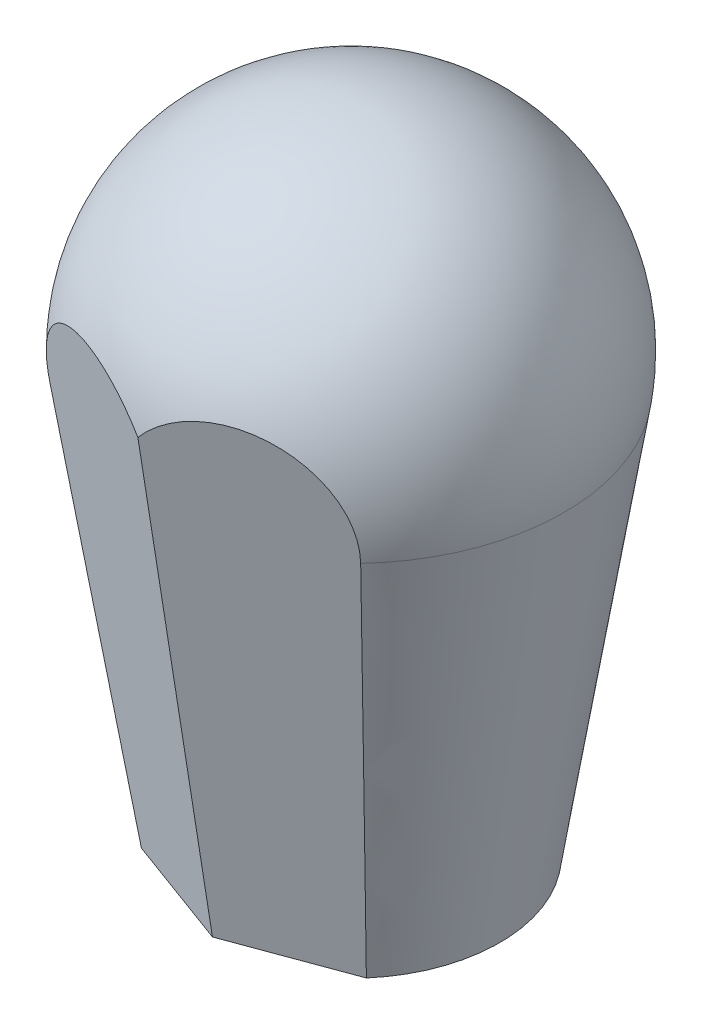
from build123d import *

# Parameters (mm, degrees)
ESQUISSE12_W            = 301.782848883
ESQUISSE12_H            = 290.028827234
ENL_V_MAT_EXTRU_1_DEPTH = 10


with BuildPart() as part:
    # Esquisse1 → R_volution1 (revolve)
    with BuildSketch(Plane.XY):
        with BuildLine():
            Line((0, 24), (-60, 24))
            Line((-60, 24), (-85.924784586, 187.364333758))
            ThreePointArc((-85.924784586, 187.364333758), (-66.163823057, 257.492021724), (0, 288))
            Line((0, 288), (0, 24))
        make_face()
    revolve(axis=Axis((0, 160.043997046, 0), (0, -1, 0)))

    # Esquisse2 → Enl_vement de mati_re-R_volution2 (revolve, cut)
    with BuildSketch(Plane.XY):
        with BuildLine():
            Line((0, 48), (0, -48))
            ThreePointArc((0, -48), (-48, 0), (0, 48))
        make_face()
    revolve(axis=Axis((0, -63.114027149, 0), (0, 1, 0)), mode=Mode.SUBTRACT)

    # Esquisse12 → Enl_v. mat.-Extru.1 (cut)
    with BuildSketch(Plane(origin=(16.55078753, -7.127051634, 44.910924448), x_dir=(0.9396926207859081, 0.05360543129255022, -0.33779318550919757), z_dir=(0.34202014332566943, -0.14727971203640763, 0.9280791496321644))):
        with Locations((92.267805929, 171.995540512)):
            Rectangle(ESQUISSE12_W, ESQUISSE12_H)
    enl_v_mat_extru_1 = extrude(amount=ENL_V_MAT_EXTRU_1_DEPTH, mode=Mode.SUBTRACT)

    # Sym_trie1: Enl_v. mat.-Extru.1 across plane
    add(enl_v_mat_extru_1.mirror(Plane(origin=(0, 0, 0), x_dir=(0, 0, 1), z_dir=(1, 0, 0))), mode=Mode.SUBTRACT)


solid = part.part
